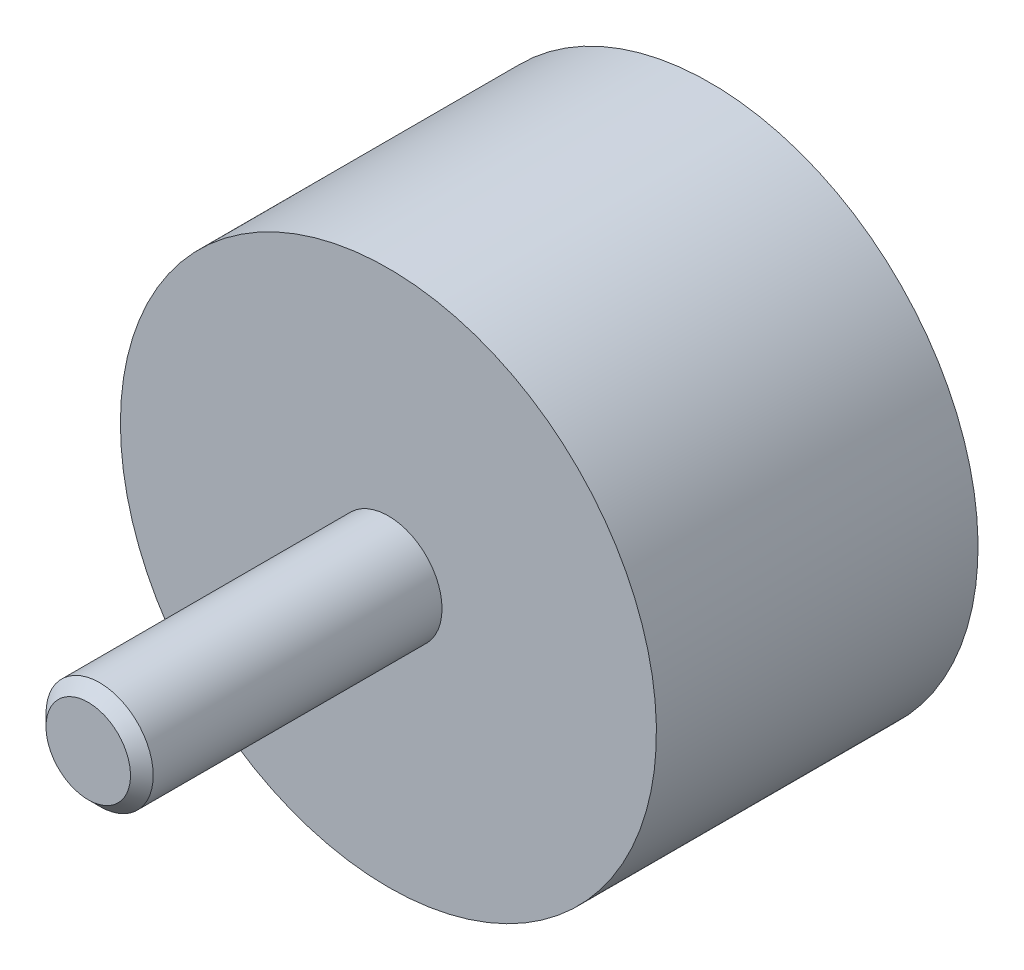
ISO-10303-21;
HEADER;
FILE_DESCRIPTION(('STEP AP214'),'2;1');
FILE_NAME('part.step','',(''),(''),'','','');
FILE_SCHEMA(('AUTOMOTIVE_DESIGN { 1 0 10303 214 1 1 1 1 }'));
ENDSEC;
DATA;
#1=APPLICATION_CONTEXT('core data for automotive mechanical design processes');
#2=APPLICATION_PROTOCOL_DEFINITION('international standard','automotive_design',2000,#1);
#3=PRODUCT_CONTEXT('',#1,'mechanical');
#4=PRODUCT('Part','Part','',(#3));
#5=PRODUCT_RELATED_PRODUCT_CATEGORY('part','',(#4));
#6=PRODUCT_DEFINITION_FORMATION('','',#4);
#7=PRODUCT_DEFINITION_CONTEXT('part definition',#1,'design');
#8=PRODUCT_DEFINITION('design','',#6,#7);
#9=PRODUCT_DEFINITION_SHAPE('','',#8);
#10=(LENGTH_UNIT() NAMED_UNIT(*) SI_UNIT(.MILLI.,.METRE.));
#11=(NAMED_UNIT(*) PLANE_ANGLE_UNIT() SI_UNIT($,.RADIAN.));
#12=(NAMED_UNIT(*) SI_UNIT($,.STERADIAN.) SOLID_ANGLE_UNIT());
#13=UNCERTAINTY_MEASURE_WITH_UNIT(LENGTH_MEASURE(1.E-05),#10,'distance_accuracy_value','');
#14=(GEOMETRIC_REPRESENTATION_CONTEXT(3) GLOBAL_UNCERTAINTY_ASSIGNED_CONTEXT((#13)) GLOBAL_UNIT_ASSIGNED_CONTEXT((#10,
#11,#12)) REPRESENTATION_CONTEXT('',''));
#15=CARTESIAN_POINT('',(0.,0.,0.));
#16=DIRECTION('',(0.,0.,1.));
#17=DIRECTION('',(1.,0.,0.));
#18=AXIS2_PLACEMENT_3D('',#15,#16,#17);
#19=CARTESIAN_POINT('',(0.,0.,0.66666666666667));
#20=DIRECTION('',(0.,0.,1.));
#21=DIRECTION('',(0.,-1.,0.));
#22=AXIS2_PLACEMENT_3D('',#19,#20,#21);
#23=CYLINDRICAL_SURFACE('',#22,25.);
#24=CARTESIAN_POINT('',(0.,0.,0.));
#25=DIRECTION('',(0.,0.,1.));
#26=DIRECTION('',(0.,-1.,0.));
#27=AXIS2_PLACEMENT_3D('',#24,#25,#26);
#28=CIRCLE('',#27,25.);
#29=CARTESIAN_POINT('',(0.,-25.,0.));
#30=VERTEX_POINT('',#29);
#31=EDGE_CURVE('E27',#30,#30,#28,.T.);
#32=ORIENTED_EDGE('',*,*,#31,.T.);
#33=EDGE_LOOP('',(#32));
#34=FACE_BOUND('',#33,.T.);
#35=CARTESIAN_POINT('',(0.,0.,30.));
#36=DIRECTION('',(0.,0.,-1.));
#37=DIRECTION('',(-1.,0.,0.));
#38=AXIS2_PLACEMENT_3D('',#35,#36,#37);
#39=CIRCLE('',#38,25.);
#40=CARTESIAN_POINT('',(-25.,0.,30.));
#41=VERTEX_POINT('',#40);
#42=EDGE_CURVE('E35',#41,#41,#39,.T.);
#43=ORIENTED_EDGE('',*,*,#42,.T.);
#44=EDGE_LOOP('',(#43));
#45=FACE_BOUND('',#44,.T.);
#46=ADVANCED_FACE('F12',(#34,#45),#23,.T.);
#47=CARTESIAN_POINT('',(25.,0.,0.));
#48=DIRECTION('',(0.,0.,-1.));
#49=DIRECTION('',(0.,1.,0.));
#50=AXIS2_PLACEMENT_3D('',#47,#48,#49);
#51=PLANE('',#50);
#52=CARTESIAN_POINT('',(0.,0.,0.));
#53=DIRECTION('',(0.,0.,-1.));
#54=DIRECTION('',(0.,1.,0.));
#55=AXIS2_PLACEMENT_3D('',#52,#53,#54);
#56=CIRCLE('',#55,5.65);
#57=CARTESIAN_POINT('',(0.,5.65,0.));
#58=VERTEX_POINT('',#57);
#59=EDGE_CURVE('E19',#58,#58,#56,.F.);
#60=ORIENTED_EDGE('',*,*,#59,.T.);
#61=EDGE_LOOP('',(#60));
#62=FACE_BOUND('',#61,.T.);
#63=ORIENTED_EDGE('',*,*,#31,.F.);
#64=EDGE_LOOP('',(#63));
#65=FACE_BOUND('',#64,.T.);
#66=ADVANCED_FACE('F58',(#62,#65),#51,.T.);
#67=CARTESIAN_POINT('',(0.,0.,0.));
#68=DIRECTION('',(0.,0.,1.));
#69=DIRECTION('',(0.,-1.,0.));
#70=AXIS2_PLACEMENT_3D('',#67,#68,#69);
#71=CYLINDRICAL_SURFACE('',#70,5.);
#72=CARTESIAN_POINT('',(0.,0.,0.65));
#73=DIRECTION('',(0.,0.,-1.));
#74=DIRECTION('',(0.,1.,0.));
#75=AXIS2_PLACEMENT_3D('',#72,#73,#74);
#76=CIRCLE('',#75,5.);
#77=CARTESIAN_POINT('',(0.,5.,0.65));
#78=VERTEX_POINT('',#77);
#79=EDGE_CURVE('E23',#78,#78,#76,.T.);
#80=ORIENTED_EDGE('',*,*,#79,.T.);
#81=EDGE_LOOP('',(#80));
#82=FACE_BOUND('',#81,.T.);
#83=CARTESIAN_POINT('',(0.,0.,10.));
#84=DIRECTION('',(0.,0.,-1.));
#85=DIRECTION('',(0.,1.,0.));
#86=AXIS2_PLACEMENT_3D('',#83,#84,#85);
#87=CIRCLE('',#86,5.);
#88=CARTESIAN_POINT('',(0.,5.,10.));
#89=VERTEX_POINT('',#88);
#90=EDGE_CURVE('E32',#89,#89,#87,.T.);
#91=ORIENTED_EDGE('',*,*,#90,.F.);
#92=EDGE_LOOP('',(#91));
#93=FACE_BOUND('',#92,.T.);
#94=ADVANCED_FACE('F63',(#82,#93),#71,.F.);
#95=CARTESIAN_POINT('',(0.,0.,10.));
#96=DIRECTION('',(0.,0.,-1.));
#97=DIRECTION('',(0.,1.,0.));
#98=AXIS2_PLACEMENT_3D('',#95,#96,#97);
#99=PLANE('',#98);
#100=ORIENTED_EDGE('',*,*,#90,.T.);
#101=EDGE_LOOP('',(#100));
#102=FACE_BOUND('',#101,.T.);
#103=ADVANCED_FACE('F69',(#102),#99,.T.);
#104=CARTESIAN_POINT('',(0.,0.,0.65));
#105=DIRECTION('',(0.,0.,-1.));
#106=DIRECTION('',(0.,1.,0.));
#107=AXIS2_PLACEMENT_3D('',#104,#105,#106);
#108=CONICAL_SURFACE('',#107,5.,0.785398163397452);
#109=ORIENTED_EDGE('',*,*,#59,.F.);
#110=EDGE_LOOP('',(#109));
#111=FACE_BOUND('',#110,.T.);
#112=ORIENTED_EDGE('',*,*,#79,.F.);
#113=EDGE_LOOP('',(#112));
#114=FACE_BOUND('',#113,.T.);
#115=ADVANCED_FACE('F14',(#111,#114),#108,.F.);
#116=CARTESIAN_POINT('',(0.,25.,30.));
#117=DIRECTION('',(0.,0.,1.));
#118=DIRECTION('',(1.,0.,0.));
#119=AXIS2_PLACEMENT_3D('',#116,#117,#118);
#120=PLANE('',#119);
#121=CARTESIAN_POINT('',(0.,0.,30.));
#122=DIRECTION('',(0.,0.,1.));
#123=DIRECTION('',(1.,0.,0.));
#124=AXIS2_PLACEMENT_3D('',#121,#122,#123);
#125=CIRCLE('',#124,5.);
#126=CARTESIAN_POINT('',(5.,0.,30.));
#127=VERTEX_POINT('',#126);
#128=EDGE_CURVE('E8',#127,#127,#125,.F.);
#129=ORIENTED_EDGE('',*,*,#128,.T.);
#130=EDGE_LOOP('',(#129));
#131=FACE_BOUND('',#130,.T.);
#132=ORIENTED_EDGE('',*,*,#42,.F.);
#133=EDGE_LOOP('',(#132));
#134=FACE_BOUND('',#133,.T.);
#135=ADVANCED_FACE('F73',(#131,#134),#120,.T.);
#136=CARTESIAN_POINT('',(0.,0.,20.));
#137=DIRECTION('',(0.,0.,1.));
#138=DIRECTION('',(0.,-1.,0.));
#139=AXIS2_PLACEMENT_3D('',#136,#137,#138);
#140=CYLINDRICAL_SURFACE('',#139,5.);
#141=ORIENTED_EDGE('',*,*,#128,.F.);
#142=EDGE_LOOP('',(#141));
#143=FACE_BOUND('',#142,.T.);
#144=CARTESIAN_POINT('',(0.,0.,56.940261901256));
#145=DIRECTION('',(0.,0.,-1.));
#146=DIRECTION('',(-1.,0.,0.));
#147=AXIS2_PLACEMENT_3D('',#144,#145,#146);
#148=CIRCLE('',#147,5.);
#149=CARTESIAN_POINT('',(-5.,0.,56.940261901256));
#150=VERTEX_POINT('',#149);
#151=EDGE_CURVE('E38',#150,#150,#148,.T.);
#152=ORIENTED_EDGE('',*,*,#151,.T.);
#153=EDGE_LOOP('',(#152));
#154=FACE_BOUND('',#153,.T.);
#155=ADVANCED_FACE('F55',(#143,#154),#140,.T.);
#156=CARTESIAN_POINT('',(0.,0.,56.940261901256));
#157=DIRECTION('',(0.,0.,-1.));
#158=DIRECTION('',(-1.,0.,0.));
#159=AXIS2_PLACEMENT_3D('',#156,#157,#158);
#160=CONICAL_SURFACE('',#159,5.,0.785398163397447);
#161=CARTESIAN_POINT('',(0.,0.,58.));
#162=DIRECTION('',(0.,0.,-1.));
#163=DIRECTION('',(-1.,0.,0.));
#164=AXIS2_PLACEMENT_3D('',#161,#162,#163);
#165=CIRCLE('',#164,3.94026190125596);
#166=CARTESIAN_POINT('',(-3.94026190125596,0.,58.));
#167=VERTEX_POINT('',#166);
#168=EDGE_CURVE('E41',#167,#167,#165,.T.);
#169=ORIENTED_EDGE('',*,*,#168,.T.);
#170=EDGE_LOOP('',(#169));
#171=FACE_BOUND('',#170,.T.);
#172=ORIENTED_EDGE('',*,*,#151,.F.);
#173=EDGE_LOOP('',(#172));
#174=FACE_BOUND('',#173,.T.);
#175=ADVANCED_FACE('F45',(#171,#174),#160,.T.);
#176=CARTESIAN_POINT('',(0.,3.94026190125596,58.));
#177=DIRECTION('',(0.,0.,1.));
#178=DIRECTION('',(1.,0.,0.));
#179=AXIS2_PLACEMENT_3D('',#176,#177,#178);
#180=PLANE('',#179);
#181=ORIENTED_EDGE('',*,*,#168,.F.);
#182=EDGE_LOOP('',(#181));
#183=FACE_BOUND('',#182,.T.);
#184=ADVANCED_FACE('F48',(#183),#180,.T.);
#185=CLOSED_SHELL('',(#46,#66,#94,#103,#115,#135,#155,#175,#184));
#186=MANIFOLD_SOLID_BREP('B1',#185);
#187=ADVANCED_BREP_SHAPE_REPRESENTATION('',(#18,#186),#14);
#188=SHAPE_DEFINITION_REPRESENTATION(#9,#187);
ENDSEC;
END-ISO-10303-21;
